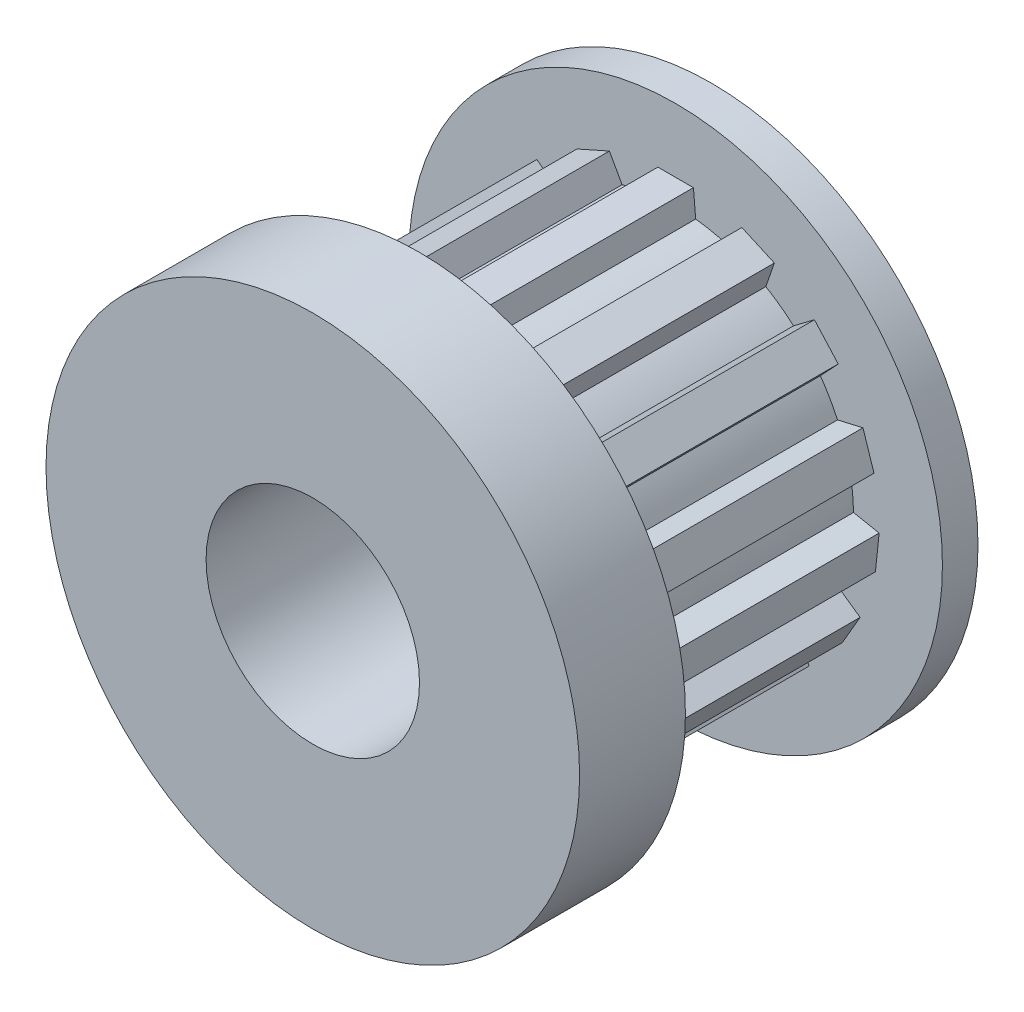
from build123d import *

# Parameters (mm, degrees)
SKETCH6_R           = 2
CUT_EXTRUDE2_DEPTH  = 20.19635382
SKETCH7_OUTSIDE_W   = 22.314
SKETCH7_OUTSIDE_H   = 22.314
SKETCH7_OUTSIDE_R   = 5
CUT_EXTRUDE3_DEPTH  = 0.6
EXTRUDE1_DEPTH      = 7
CIRPATTERN1_COUNT   = 15
CHAMFER1_SIZE       = 1.6
CHAMFER1_SIZE2      = 0.224865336
SKETCH13_OUTSIDE_W  = 22.314
SKETCH13_OUTSIDE_H  = 22.314
SKETCH13_OUTSIDE_R  = 5
CUT_EXTRUDE9_DEPTH  = 0.5
SKETCH15_R          = 13.043138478
CUT_EXTRUDE11_DEPTH = 4.2
SKETCH17_R          = 2.99974
CUT_EXTRUDE13_DEPTH = 16.866316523


with BuildPart() as part:
    # Sketch2 → Revolve1 (revolve)
    with BuildSketch(Plane(origin=(0, 0, 0), x_dir=(1, 0, 0), z_dir=(0, 1, 0))):
        Polygon((0, 0), (0, 16), (7.5, 16), (7.5, 14.4), (5, 14.4), (5, 7.4), (7.5, 7.4), (7.5, 0), align=None)
    revolve(axis=Axis((0, 0, 0), (0, 0, -1)))

    # Sketch6 → Cut-Extrude2 (cut, through all)
    with BuildSketch(Plane(origin=(0, 0, -16), x_dir=(-1, 0, 0), z_dir=(0, 0, -1))):
        Circle(SKETCH6_R)
    extrude(amount=-CUT_EXTRUDE2_DEPTH, mode=Mode.SUBTRACT)

    # Sketch7 outside → Cut-Extrude3 (cut)
    with BuildSketch(Plane(origin=(0, 0, -16), x_dir=(-1, 0, 0), z_dir=(0, 0, -1))):
        Rectangle(SKETCH7_OUTSIDE_W, SKETCH7_OUTSIDE_H)
        with Locations(Location((0, 0, 0), (0, 0, 180))):
            Circle(SKETCH7_OUTSIDE_R, mode=Mode.SUBTRACT)
    extrude(amount=-CUT_EXTRUDE3_DEPTH, mode=Mode.SUBTRACT)

    # Sketch10 → Extrude1 (add)
    with BuildSketch(Plane(origin=(0, 0, -7.4), x_dir=(-1, 0, 0), z_dir=(0, 0, -1))):
        with BuildLine():
            Line((-0.5, 5.7), (0.5, 5.7))
            Line((0.5, 5.7), (0.564034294, 4.968084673))
            ThreePointArc((0.564034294, 4.968084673), (0, 5), (-0.564034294, 4.968084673))
            Line((-0.564034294, 4.968084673), (-0.5, 5.7))
        make_face()
    extrude1 = extrude(amount=EXTRUDE1_DEPTH)

    # CirPattern1: Extrude1 ×15 about axis
    cirpattern1_axis = Axis((0, 0, 0), (0, 0, 1))
    for i in range(1, CIRPATTERN1_COUNT):
        add(extrude1.rotate(cirpattern1_axis, i * 360 / CIRPATTERN1_COUNT))

    # Chamfer1
    chamfer1_edges = [part.edges().sort_by_distance(p)[0] for p in [
        (-7.5, 0, -7.4),
    ]]
    chamfer1_side = [part.faces().sort_by_distance(p)[0] for p in [
        (-7.287867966, 0, -7.4),
    ]]
    chamfer(chamfer1_edges, length=CHAMFER1_SIZE, length2=CHAMFER1_SIZE2, reference=chamfer1_side[0])

    # Sketch13 outside → Cut-Extrude9 (cut)
    with BuildSketch(Plane.XY):
        Rectangle(SKETCH13_OUTSIDE_W, SKETCH13_OUTSIDE_H)
        with Locations(Location((0, 0, 0), (0, 0, 180))):
            Circle(SKETCH13_OUTSIDE_R, mode=Mode.SUBTRACT)
    extrude(amount=-CUT_EXTRUDE9_DEPTH, mode=Mode.SUBTRACT)

    # Sketch15 → Cut-Extrude11 (cut)
    with BuildSketch(Plane.XY):
        Circle(SKETCH15_R)
    extrude(amount=-CUT_EXTRUDE11_DEPTH, mode=Mode.SUBTRACT)

    # Sketch17 → Cut-Extrude13 (cut, through all)
    with BuildSketch(Plane.XY.offset(-4.2)):
        Circle(SKETCH17_R)
    extrude(amount=-CUT_EXTRUDE13_DEPTH, mode=Mode.SUBTRACT)


solid = part.part
